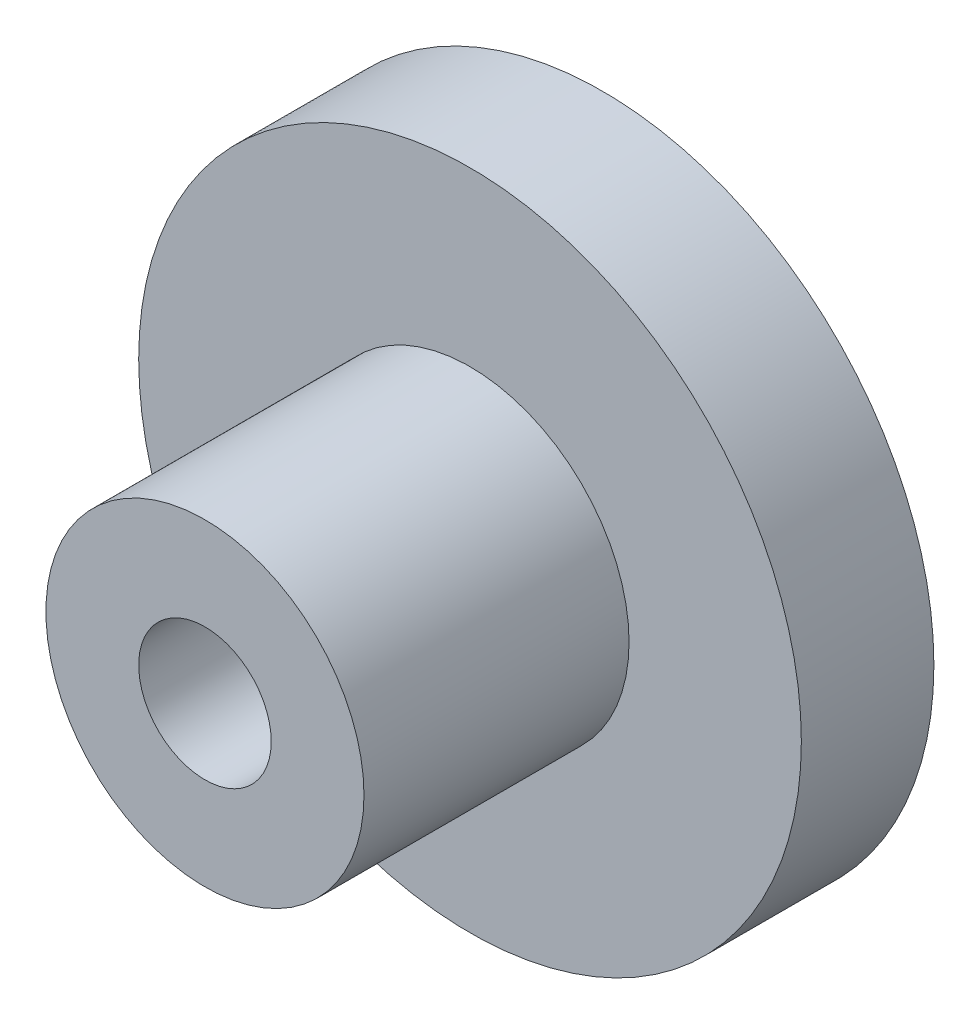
from build123d import *

# Parameters (mm, degrees)
SZKIC1_R                    = 12.5
SZKIC1_R_2                  = 2.5
DODANIE_WYCI_GNI_CIE1_DEPTH = 15
SZKIC2_OUTSIDE_W            = 34.682
SZKIC2_OUTSIDE_H            = 34.682
SZKIC2_OUTSIDE_R            = 6
WYTNIJ_WYCI_GNI_CIE1_DEPTH  = 10


with BuildPart() as part:
    # Szkic1 → Dodanie-wyci_gni_cie1 (new body)
    with BuildSketch(Plane.XY):
        Circle(SZKIC1_R)
        Circle(SZKIC1_R_2, mode=Mode.SUBTRACT)
    extrude(amount=DODANIE_WYCI_GNI_CIE1_DEPTH)

    # Szkic2 outside → Wytnij-wyci_gni_cie1 (cut)
    with BuildSketch(Plane.XY.offset(15)):
        Rectangle(SZKIC2_OUTSIDE_W, SZKIC2_OUTSIDE_H)
        Circle(SZKIC2_OUTSIDE_R, mode=Mode.SUBTRACT)
    extrude(amount=-WYTNIJ_WYCI_GNI_CIE1_DEPTH, mode=Mode.SUBTRACT)


solid = part.part
